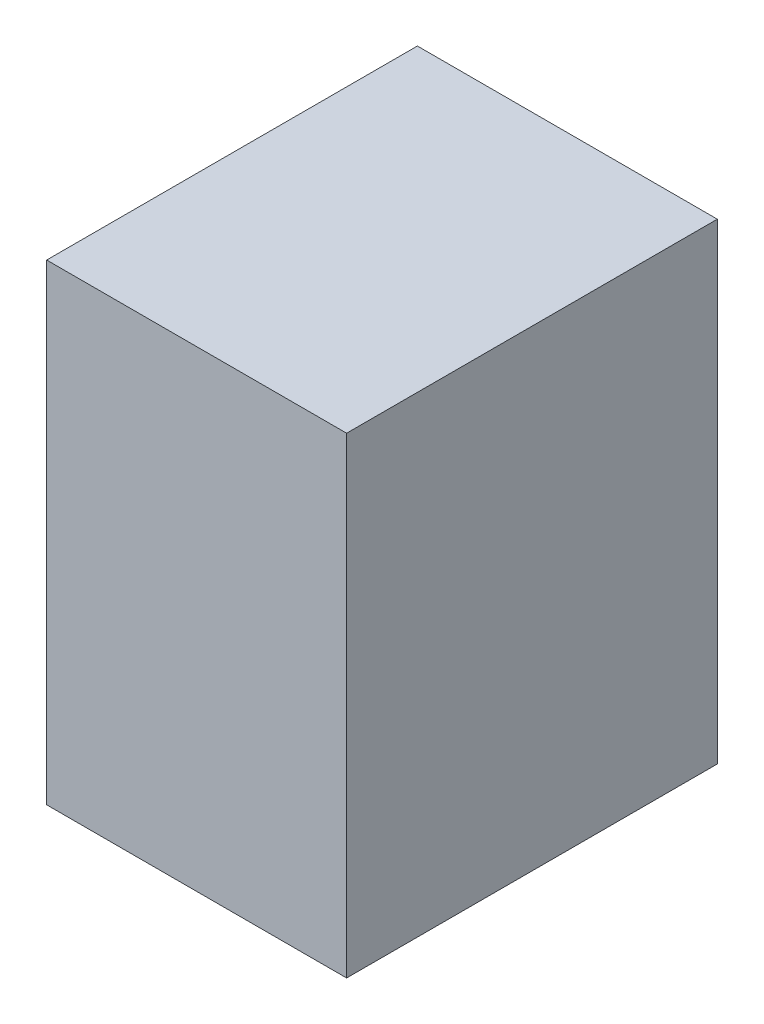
ISO-10303-21;
HEADER;
FILE_DESCRIPTION(('STEP AP214'),'2;1');
FILE_NAME('part.step','',(''),(''),'','','');
FILE_SCHEMA(('AUTOMOTIVE_DESIGN { 1 0 10303 214 1 1 1 1 }'));
ENDSEC;
DATA;
#1=APPLICATION_CONTEXT('core data for automotive mechanical design processes');
#2=APPLICATION_PROTOCOL_DEFINITION('international standard','automotive_design',2000,#1);
#3=PRODUCT_CONTEXT('',#1,'mechanical');
#4=PRODUCT('Part','Part','',(#3));
#5=PRODUCT_RELATED_PRODUCT_CATEGORY('part','',(#4));
#6=PRODUCT_DEFINITION_FORMATION('','',#4);
#7=PRODUCT_DEFINITION_CONTEXT('part definition',#1,'design');
#8=PRODUCT_DEFINITION('design','',#6,#7);
#9=PRODUCT_DEFINITION_SHAPE('','',#8);
#10=(LENGTH_UNIT() NAMED_UNIT(*) SI_UNIT(.MILLI.,.METRE.));
#11=(NAMED_UNIT(*) PLANE_ANGLE_UNIT() SI_UNIT($,.RADIAN.));
#12=(NAMED_UNIT(*) SI_UNIT($,.STERADIAN.) SOLID_ANGLE_UNIT());
#13=UNCERTAINTY_MEASURE_WITH_UNIT(LENGTH_MEASURE(1.E-05),#10,'distance_accuracy_value','');
#14=(GEOMETRIC_REPRESENTATION_CONTEXT(3) GLOBAL_UNCERTAINTY_ASSIGNED_CONTEXT((#13)) GLOBAL_UNIT_ASSIGNED_CONTEXT((#10,
#11,#12)) REPRESENTATION_CONTEXT('',''));
#15=CARTESIAN_POINT('',(0.,0.,0.));
#16=DIRECTION('',(0.,0.,1.));
#17=DIRECTION('',(1.,0.,0.));
#18=AXIS2_PLACEMENT_3D('',#15,#16,#17);
#19=CARTESIAN_POINT('',(1.269999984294E-06,0.,0.5499989));
#20=DIRECTION('',(0.,0.,1.));
#21=DIRECTION('',(1.,0.,0.));
#22=AXIS2_PLACEMENT_3D('',#19,#20,#21);
#23=PLANE('',#22);
#24=DIRECTION('',(1.,0.,0.));
#25=VECTOR('',#24,1.);
#26=CARTESIAN_POINT('',(-0.22249892,-0.3499993,0.5499989));
#27=LINE('',#26,#25);
#28=CARTESIAN_POINT('',(-0.22249892,-0.3499993,0.5499989));
#29=VERTEX_POINT('',#28);
#30=CARTESIAN_POINT('',(0.22250146,-0.3499993,0.5499989));
#31=VERTEX_POINT('',#30);
#32=EDGE_CURVE('E87',#29,#31,#27,.T.);
#33=ORIENTED_EDGE('',*,*,#32,.T.);
#34=DIRECTION('',(0.,1.,0.));
#35=VECTOR('',#34,1.);
#36=CARTESIAN_POINT('',(0.22250146,-0.3499993,0.5499989));
#37=LINE('',#36,#35);
#38=CARTESIAN_POINT('',(0.22250146,0.3499993,0.5499989));
#39=VERTEX_POINT('',#38);
#40=EDGE_CURVE('E73',#31,#39,#37,.T.);
#41=ORIENTED_EDGE('',*,*,#40,.T.);
#42=DIRECTION('',(-1.,0.,0.));
#43=VECTOR('',#42,1.);
#44=CARTESIAN_POINT('',(0.22250146,0.3499993,0.5499989));
#45=LINE('',#44,#43);
#46=CARTESIAN_POINT('',(-0.22249892,0.3499993,0.5499989));
#47=VERTEX_POINT('',#46);
#48=EDGE_CURVE('E104',#39,#47,#45,.T.);
#49=ORIENTED_EDGE('',*,*,#48,.T.);
#50=DIRECTION('',(0.,-1.,0.));
#51=VECTOR('',#50,1.);
#52=CARTESIAN_POINT('',(-0.22249892,0.3499993,0.5499989));
#53=LINE('',#52,#51);
#54=EDGE_CURVE('E11',#47,#29,#53,.T.);
#55=ORIENTED_EDGE('',*,*,#54,.T.);
#56=EDGE_LOOP('',(#33,#41,#49,#55));
#57=FACE_BOUND('',#56,.T.);
#58=ADVANCED_FACE('F17',(#57),#23,.T.);
#59=CARTESIAN_POINT('',(1.269999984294E-06,0.,0.));
#60=DIRECTION('',(0.,0.,1.));
#61=DIRECTION('',(1.,0.,0.));
#62=AXIS2_PLACEMENT_3D('',#59,#60,#61);
#63=PLANE('',#62);
#64=DIRECTION('',(0.,-1.,0.));
#65=VECTOR('',#64,1.);
#66=CARTESIAN_POINT('',(-0.22249892,0.3499993,0.));
#67=LINE('',#66,#65);
#68=CARTESIAN_POINT('',(-0.22249892,0.3499993,0.));
#69=VERTEX_POINT('',#68);
#70=CARTESIAN_POINT('',(-0.22249892,-0.3499993,0.));
#71=VERTEX_POINT('',#70);
#72=EDGE_CURVE('E27',#69,#71,#67,.T.);
#73=ORIENTED_EDGE('',*,*,#72,.F.);
#74=DIRECTION('',(-1.,0.,0.));
#75=VECTOR('',#74,1.);
#76=CARTESIAN_POINT('',(0.22250146,0.3499993,0.));
#77=LINE('',#76,#75);
#78=CARTESIAN_POINT('',(0.22250146,0.3499993,0.));
#79=VERTEX_POINT('',#78);
#80=EDGE_CURVE('E84',#79,#69,#77,.T.);
#81=ORIENTED_EDGE('',*,*,#80,.F.);
#82=DIRECTION('',(0.,1.,0.));
#83=VECTOR('',#82,1.);
#84=CARTESIAN_POINT('',(0.22250146,-0.3499993,0.));
#85=LINE('',#84,#83);
#86=CARTESIAN_POINT('',(0.22250146,-0.3499993,0.));
#87=VERTEX_POINT('',#86);
#88=EDGE_CURVE('E110',#87,#79,#85,.T.);
#89=ORIENTED_EDGE('',*,*,#88,.F.);
#90=DIRECTION('',(1.,0.,0.));
#91=VECTOR('',#90,1.);
#92=CARTESIAN_POINT('',(-0.22249892,-0.3499993,0.));
#93=LINE('',#92,#91);
#94=EDGE_CURVE('E94',#71,#87,#93,.T.);
#95=ORIENTED_EDGE('',*,*,#94,.F.);
#96=EDGE_LOOP('',(#73,#81,#89,#95));
#97=FACE_BOUND('',#96,.T.);
#98=ADVANCED_FACE('F19',(#97),#63,.F.);
#99=CARTESIAN_POINT('',(-0.22249892,0.3499993,0.));
#100=DIRECTION('',(1.,0.,0.));
#101=DIRECTION('',(0.,1.,0.));
#102=AXIS2_PLACEMENT_3D('',#99,#100,#101);
#103=PLANE('',#102);
#104=ORIENTED_EDGE('',*,*,#72,.T.);
#105=DIRECTION('',(0.,0.,1.));
#106=VECTOR('',#105,1.);
#107=CARTESIAN_POINT('',(-0.22249892,-0.3499993,0.));
#108=LINE('',#107,#106);
#109=EDGE_CURVE('E91',#71,#29,#108,.T.);
#110=ORIENTED_EDGE('',*,*,#109,.T.);
#111=ORIENTED_EDGE('',*,*,#54,.F.);
#112=DIRECTION('',(0.,0.,1.));
#113=VECTOR('',#112,1.);
#114=CARTESIAN_POINT('',(-0.22249892,0.3499993,0.));
#115=LINE('',#114,#113);
#116=EDGE_CURVE('E21',#69,#47,#115,.T.);
#117=ORIENTED_EDGE('',*,*,#116,.F.);
#118=EDGE_LOOP('',(#104,#110,#111,#117));
#119=FACE_BOUND('',#118,.T.);
#120=ADVANCED_FACE('F124',(#119),#103,.F.);
#121=CARTESIAN_POINT('',(0.22250146,0.3499993,0.));
#122=DIRECTION('',(0.,-1.,0.));
#123=DIRECTION('',(0.,0.,-1.));
#124=AXIS2_PLACEMENT_3D('',#121,#122,#123);
#125=PLANE('',#124);
#126=ORIENTED_EDGE('',*,*,#80,.T.);
#127=ORIENTED_EDGE('',*,*,#116,.T.);
#128=ORIENTED_EDGE('',*,*,#48,.F.);
#129=DIRECTION('',(0.,0.,1.));
#130=VECTOR('',#129,1.);
#131=CARTESIAN_POINT('',(0.22250146,0.3499993,0.));
#132=LINE('',#131,#130);
#133=EDGE_CURVE('E81',#79,#39,#132,.T.);
#134=ORIENTED_EDGE('',*,*,#133,.F.);
#135=EDGE_LOOP('',(#126,#127,#128,#134));
#136=FACE_BOUND('',#135,.T.);
#137=ADVANCED_FACE('F123',(#136),#125,.F.);
#138=CARTESIAN_POINT('',(0.22250146,-0.3499993,0.));
#139=DIRECTION('',(-1.,0.,0.));
#140=DIRECTION('',(0.,0.,1.));
#141=AXIS2_PLACEMENT_3D('',#138,#139,#140);
#142=PLANE('',#141);
#143=ORIENTED_EDGE('',*,*,#88,.T.);
#144=ORIENTED_EDGE('',*,*,#133,.T.);
#145=ORIENTED_EDGE('',*,*,#40,.F.);
#146=DIRECTION('',(0.,0.,1.));
#147=VECTOR('',#146,1.);
#148=CARTESIAN_POINT('',(0.22250146,-0.3499993,0.));
#149=LINE('',#148,#147);
#150=EDGE_CURVE('E78',#87,#31,#149,.T.);
#151=ORIENTED_EDGE('',*,*,#150,.F.);
#152=EDGE_LOOP('',(#143,#144,#145,#151));
#153=FACE_BOUND('',#152,.T.);
#154=ADVANCED_FACE('F76',(#153),#142,.F.);
#155=CARTESIAN_POINT('',(-0.22249892,-0.3499993,0.));
#156=DIRECTION('',(0.,1.,0.));
#157=DIRECTION('',(1.,0.,0.));
#158=AXIS2_PLACEMENT_3D('',#155,#156,#157);
#159=PLANE('',#158);
#160=ORIENTED_EDGE('',*,*,#94,.T.);
#161=ORIENTED_EDGE('',*,*,#150,.T.);
#162=ORIENTED_EDGE('',*,*,#32,.F.);
#163=ORIENTED_EDGE('',*,*,#109,.F.);
#164=EDGE_LOOP('',(#160,#161,#162,#163));
#165=FACE_BOUND('',#164,.T.);
#166=ADVANCED_FACE('F93',(#165),#159,.F.);
#167=CLOSED_SHELL('',(#58,#98,#120,#137,#154,#166));
#168=MANIFOLD_SOLID_BREP('B1',#167);
#169=ADVANCED_BREP_SHAPE_REPRESENTATION('',(#18,#168),#14);
#170=SHAPE_DEFINITION_REPRESENTATION(#9,#169);
ENDSEC;
END-ISO-10303-21;
